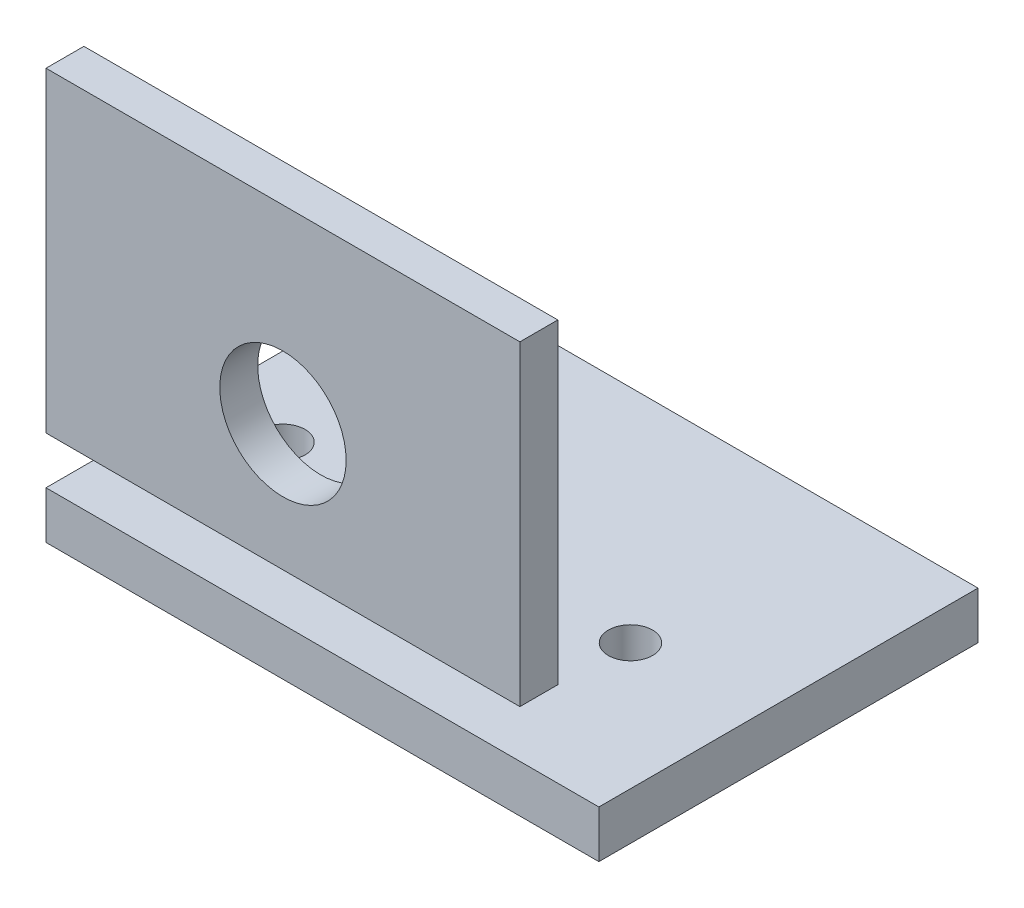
ISO-10303-21;
HEADER;
FILE_DESCRIPTION(('STEP AP214'),'2;1');
FILE_NAME('part.step','',(''),(''),'','','');
FILE_SCHEMA(('AUTOMOTIVE_DESIGN { 1 0 10303 214 1 1 1 1 }'));
ENDSEC;
DATA;
#1=APPLICATION_CONTEXT('core data for automotive mechanical design processes');
#2=APPLICATION_PROTOCOL_DEFINITION('international standard','automotive_design',2000,#1);
#3=PRODUCT_CONTEXT('',#1,'mechanical');
#4=PRODUCT('Part','Part','',(#3));
#5=PRODUCT_RELATED_PRODUCT_CATEGORY('part','',(#4));
#6=PRODUCT_DEFINITION_FORMATION('','',#4);
#7=PRODUCT_DEFINITION_CONTEXT('part definition',#1,'design');
#8=PRODUCT_DEFINITION('design','',#6,#7);
#9=PRODUCT_DEFINITION_SHAPE('','',#8);
#10=(LENGTH_UNIT() NAMED_UNIT(*) SI_UNIT(.MILLI.,.METRE.));
#11=(NAMED_UNIT(*) PLANE_ANGLE_UNIT() SI_UNIT($,.RADIAN.));
#12=(NAMED_UNIT(*) SI_UNIT($,.STERADIAN.) SOLID_ANGLE_UNIT());
#13=UNCERTAINTY_MEASURE_WITH_UNIT(LENGTH_MEASURE(1.E-05),#10,'distance_accuracy_value','');
#14=(GEOMETRIC_REPRESENTATION_CONTEXT(3) GLOBAL_UNCERTAINTY_ASSIGNED_CONTEXT((#13)) GLOBAL_UNIT_ASSIGNED_CONTEXT((#10,
#11,#12)) REPRESENTATION_CONTEXT('',''));
#15=CARTESIAN_POINT('',(0.,0.,0.));
#16=DIRECTION('',(0.,0.,1.));
#17=DIRECTION('',(1.,0.,0.));
#18=AXIS2_PLACEMENT_3D('',#15,#16,#17);
#19=CARTESIAN_POINT('',(0.,15.,-12.));
#20=DIRECTION('',(-1.,0.,0.));
#21=DIRECTION('',(0.,0.,1.));
#22=AXIS2_PLACEMENT_3D('',#19,#20,#21);
#23=PLANE('',#22);
#24=DIRECTION('',(0.,-1.,0.));
#25=VECTOR('',#24,1.);
#26=CARTESIAN_POINT('',(0.,15.,0.));
#27=LINE('',#26,#25);
#28=CARTESIAN_POINT('',(0.,115.,0.));
#29=VERTEX_POINT('',#28);
#30=CARTESIAN_POINT('',(0.,15.,0.));
#31=VERTEX_POINT('',#30);
#32=EDGE_CURVE('E116',#29,#31,#27,.T.);
#33=ORIENTED_EDGE('',*,*,#32,.F.);
#34=DIRECTION('',(0.,0.,1.));
#35=VECTOR('',#34,1.);
#36=CARTESIAN_POINT('',(0.,115.,-12.));
#37=LINE('',#36,#35);
#38=CARTESIAN_POINT('',(0.,115.,-12.));
#39=VERTEX_POINT('',#38);
#40=EDGE_CURVE('E12',#39,#29,#37,.T.);
#41=ORIENTED_EDGE('',*,*,#40,.F.);
#42=DIRECTION('',(0.,-1.,0.));
#43=VECTOR('',#42,1.);
#44=CARTESIAN_POINT('',(0.,15.,-12.));
#45=LINE('',#44,#43);
#46=CARTESIAN_POINT('',(0.,15.,-12.));
#47=VERTEX_POINT('',#46);
#48=EDGE_CURVE('E107',#39,#47,#45,.T.);
#49=ORIENTED_EDGE('',*,*,#48,.T.);
#50=DIRECTION('',(0.,0.,1.));
#51=VECTOR('',#50,1.);
#52=CARTESIAN_POINT('',(0.,15.,-12.));
#53=LINE('',#52,#51);
#54=EDGE_CURVE('E53',#47,#31,#53,.T.);
#55=ORIENTED_EDGE('',*,*,#54,.T.);
#56=EDGE_LOOP('',(#33,#41,#49,#55));
#57=FACE_BOUND('',#56,.T.);
#58=ADVANCED_FACE('F51',(#57),#23,.T.);
#59=CARTESIAN_POINT('',(0.,115.,-12.));
#60=DIRECTION('',(0.,1.,0.));
#61=DIRECTION('',(0.,0.,1.));
#62=AXIS2_PLACEMENT_3D('',#59,#60,#61);
#63=PLANE('',#62);
#64=DIRECTION('',(-1.,0.,0.));
#65=VECTOR('',#64,1.);
#66=CARTESIAN_POINT('',(0.,115.,0.));
#67=LINE('',#66,#65);
#68=CARTESIAN_POINT('',(150.,115.,0.));
#69=VERTEX_POINT('',#68);
#70=EDGE_CURVE('E111',#69,#29,#67,.T.);
#71=ORIENTED_EDGE('',*,*,#70,.F.);
#72=DIRECTION('',(0.,0.,1.));
#73=VECTOR('',#72,1.);
#74=CARTESIAN_POINT('',(150.,115.,-12.));
#75=LINE('',#74,#73);
#76=CARTESIAN_POINT('',(150.,115.,-12.));
#77=VERTEX_POINT('',#76);
#78=EDGE_CURVE('E58',#77,#69,#75,.T.);
#79=ORIENTED_EDGE('',*,*,#78,.F.);
#80=DIRECTION('',(-1.,0.,0.));
#81=VECTOR('',#80,1.);
#82=CARTESIAN_POINT('',(0.,115.,-12.));
#83=LINE('',#82,#81);
#84=EDGE_CURVE('E106',#77,#39,#83,.T.);
#85=ORIENTED_EDGE('',*,*,#84,.T.);
#86=ORIENTED_EDGE('',*,*,#40,.T.);
#87=EDGE_LOOP('',(#71,#79,#85,#86));
#88=FACE_BOUND('',#87,.T.);
#89=ADVANCED_FACE('F126',(#88),#63,.T.);
#90=CARTESIAN_POINT('',(150.,15.,-12.));
#91=DIRECTION('',(1.,0.,0.));
#92=DIRECTION('',(0.,0.,-1.));
#93=AXIS2_PLACEMENT_3D('',#90,#91,#92);
#94=PLANE('',#93);
#95=DIRECTION('',(0.,1.,0.));
#96=VECTOR('',#95,1.);
#97=CARTESIAN_POINT('',(150.,15.,0.));
#98=LINE('',#97,#96);
#99=CARTESIAN_POINT('',(150.,15.,0.));
#100=VERTEX_POINT('',#99);
#101=EDGE_CURVE('E103',#100,#69,#98,.T.);
#102=ORIENTED_EDGE('',*,*,#101,.F.);
#103=DIRECTION('',(0.,0.,1.));
#104=VECTOR('',#103,1.);
#105=CARTESIAN_POINT('',(150.,15.,-12.));
#106=LINE('',#105,#104);
#107=CARTESIAN_POINT('',(150.,15.,-12.));
#108=VERTEX_POINT('',#107);
#109=EDGE_CURVE('E98',#108,#100,#106,.T.);
#110=ORIENTED_EDGE('',*,*,#109,.F.);
#111=DIRECTION('',(0.,1.,0.));
#112=VECTOR('',#111,1.);
#113=CARTESIAN_POINT('',(150.,15.,-12.));
#114=LINE('',#113,#112);
#115=EDGE_CURVE('E100',#108,#77,#114,.T.);
#116=ORIENTED_EDGE('',*,*,#115,.T.);
#117=ORIENTED_EDGE('',*,*,#78,.T.);
#118=EDGE_LOOP('',(#102,#110,#116,#117));
#119=FACE_BOUND('',#118,.T.);
#120=ADVANCED_FACE('F96',(#119),#94,.T.);
#121=CARTESIAN_POINT('',(0.,15.,-12.));
#122=DIRECTION('',(0.,-1.,0.));
#123=DIRECTION('',(0.,0.,-1.));
#124=AXIS2_PLACEMENT_3D('',#121,#122,#123);
#125=PLANE('',#124);
#126=DIRECTION('',(1.,0.,0.));
#127=VECTOR('',#126,1.);
#128=CARTESIAN_POINT('',(0.,15.,0.));
#129=LINE('',#128,#127);
#130=EDGE_CURVE('E118',#31,#100,#129,.T.);
#131=ORIENTED_EDGE('',*,*,#130,.F.);
#132=ORIENTED_EDGE('',*,*,#54,.F.);
#133=DIRECTION('',(1.,0.,0.));
#134=VECTOR('',#133,1.);
#135=CARTESIAN_POINT('',(0.,15.,-12.));
#136=LINE('',#135,#134);
#137=EDGE_CURVE('E102',#47,#108,#136,.T.);
#138=ORIENTED_EDGE('',*,*,#137,.T.);
#139=ORIENTED_EDGE('',*,*,#109,.T.);
#140=EDGE_LOOP('',(#131,#132,#138,#139));
#141=FACE_BOUND('',#140,.T.);
#142=ADVANCED_FACE('F108',(#141),#125,.T.);
#143=CARTESIAN_POINT('',(0.,0.,-12.));
#144=DIRECTION('',(0.,0.,-1.));
#145=DIRECTION('',(-1.,0.,0.));
#146=AXIS2_PLACEMENT_3D('',#143,#144,#145);
#147=PLANE('',#146);
#148=CARTESIAN_POINT('',(75.,55.,-12.));
#149=DIRECTION('',(0.,0.,1.));
#150=DIRECTION('',(1.,0.,0.));
#151=AXIS2_PLACEMENT_3D('',#148,#149,#150);
#152=CIRCLE('',#151,20.);
#153=CARTESIAN_POINT('',(95.,55.,-12.));
#154=VERTEX_POINT('',#153);
#155=EDGE_CURVE('E119',#154,#154,#152,.T.);
#156=ORIENTED_EDGE('',*,*,#155,.T.);
#157=EDGE_LOOP('',(#156));
#158=FACE_BOUND('',#157,.T.);
#159=ORIENTED_EDGE('',*,*,#48,.F.);
#160=ORIENTED_EDGE('',*,*,#84,.F.);
#161=ORIENTED_EDGE('',*,*,#115,.F.);
#162=ORIENTED_EDGE('',*,*,#137,.F.);
#163=EDGE_LOOP('',(#159,#160,#161,#162));
#164=FACE_BOUND('',#163,.T.);
#165=ADVANCED_FACE('F104',(#158,#164),#147,.T.);
#166=CARTESIAN_POINT('',(0.,0.,0.));
#167=DIRECTION('',(0.,0.,-1.));
#168=DIRECTION('',(-1.,0.,0.));
#169=AXIS2_PLACEMENT_3D('',#166,#167,#168);
#170=PLANE('',#169);
#171=CARTESIAN_POINT('',(75.,55.,0.));
#172=DIRECTION('',(0.,0.,1.));
#173=DIRECTION('',(1.,0.,0.));
#174=AXIS2_PLACEMENT_3D('',#171,#172,#173);
#175=CIRCLE('',#174,20.);
#176=CARTESIAN_POINT('',(95.,55.,0.));
#177=VERTEX_POINT('',#176);
#178=EDGE_CURVE('E157',#177,#177,#175,.T.);
#179=ORIENTED_EDGE('',*,*,#178,.F.);
#180=EDGE_LOOP('',(#179));
#181=FACE_BOUND('',#180,.T.);
#182=ORIENTED_EDGE('',*,*,#32,.T.);
#183=ORIENTED_EDGE('',*,*,#130,.T.);
#184=ORIENTED_EDGE('',*,*,#101,.T.);
#185=ORIENTED_EDGE('',*,*,#70,.T.);
#186=EDGE_LOOP('',(#182,#183,#184,#185));
#187=FACE_BOUND('',#186,.T.);
#188=ADVANCED_FACE('F129',(#181,#187),#170,.F.);
#189=CARTESIAN_POINT('',(75.,55.,-12.));
#190=DIRECTION('',(0.,0.,1.));
#191=DIRECTION('',(1.,0.,0.));
#192=AXIS2_PLACEMENT_3D('',#189,#190,#191);
#193=CYLINDRICAL_SURFACE('',#192,20.);
#194=ORIENTED_EDGE('',*,*,#155,.F.);
#195=EDGE_LOOP('',(#194));
#196=FACE_BOUND('',#195,.T.);
#197=ORIENTED_EDGE('',*,*,#178,.T.);
#198=EDGE_LOOP('',(#197));
#199=FACE_BOUND('',#198,.T.);
#200=ADVANCED_FACE('F143',(#196,#199),#193,.F.);
#201=CLOSED_SHELL('',(#58,#89,#120,#142,#165,#188,#200));
#202=MANIFOLD_SOLID_BREP('B2',#201);
#203=CARTESIAN_POINT('',(0.,-15.,0.));
#204=DIRECTION('',(-1.,0.,0.));
#205=DIRECTION('',(0.,0.,1.));
#206=AXIS2_PLACEMENT_3D('',#203,#204,#205);
#207=PLANE('',#206);
#208=DIRECTION('',(0.,0.,1.));
#209=VECTOR('',#208,1.);
#210=CARTESIAN_POINT('',(0.,0.,0.));
#211=LINE('',#210,#209);
#212=CARTESIAN_POINT('',(0.,0.,-120.));
#213=VERTEX_POINT('',#212);
#214=CARTESIAN_POINT('',(0.,0.,0.));
#215=VERTEX_POINT('',#214);
#216=EDGE_CURVE('E262',#213,#215,#211,.T.);
#217=ORIENTED_EDGE('',*,*,#216,.F.);
#218=DIRECTION('',(0.,1.,0.));
#219=VECTOR('',#218,1.);
#220=CARTESIAN_POINT('',(0.,-15.,-120.));
#221=LINE('',#220,#219);
#222=CARTESIAN_POINT('',(0.,-15.,-120.));
#223=VERTEX_POINT('',#222);
#224=EDGE_CURVE('E47',#223,#213,#221,.T.);
#225=ORIENTED_EDGE('',*,*,#224,.F.);
#226=DIRECTION('',(0.,0.,1.));
#227=VECTOR('',#226,1.);
#228=CARTESIAN_POINT('',(0.,-15.,0.));
#229=LINE('',#228,#227);
#230=CARTESIAN_POINT('',(0.,-15.,0.));
#231=VERTEX_POINT('',#230);
#232=EDGE_CURVE('E251',#223,#231,#229,.T.);
#233=ORIENTED_EDGE('',*,*,#232,.T.);
#234=DIRECTION('',(0.,1.,0.));
#235=VECTOR('',#234,1.);
#236=CARTESIAN_POINT('',(0.,-15.,0.));
#237=LINE('',#236,#235);
#238=EDGE_CURVE('E196',#231,#215,#237,.T.);
#239=ORIENTED_EDGE('',*,*,#238,.T.);
#240=EDGE_LOOP('',(#217,#225,#233,#239));
#241=FACE_BOUND('',#240,.T.);
#242=ADVANCED_FACE('F197',(#241),#207,.T.);
#243=CARTESIAN_POINT('',(0.,-15.,-120.));
#244=DIRECTION('',(0.,0.,-1.));
#245=DIRECTION('',(-1.,0.,0.));
#246=AXIS2_PLACEMENT_3D('',#243,#244,#245);
#247=PLANE('',#246);
#248=DIRECTION('',(-1.,0.,0.));
#249=VECTOR('',#248,1.);
#250=CARTESIAN_POINT('',(0.,0.,-120.));
#251=LINE('',#250,#249);
#252=CARTESIAN_POINT('',(175.,0.,-120.));
#253=VERTEX_POINT('',#252);
#254=EDGE_CURVE('E259',#253,#213,#251,.T.);
#255=ORIENTED_EDGE('',*,*,#254,.F.);
#256=DIRECTION('',(0.,1.,0.));
#257=VECTOR('',#256,1.);
#258=CARTESIAN_POINT('',(175.,-15.,-120.));
#259=LINE('',#258,#257);
#260=CARTESIAN_POINT('',(175.,-15.,-120.));
#261=VERTEX_POINT('',#260);
#262=EDGE_CURVE('E205',#261,#253,#259,.T.);
#263=ORIENTED_EDGE('',*,*,#262,.F.);
#264=DIRECTION('',(-1.,0.,0.));
#265=VECTOR('',#264,1.);
#266=CARTESIAN_POINT('',(0.,-15.,-120.));
#267=LINE('',#266,#265);
#268=EDGE_CURVE('E252',#261,#223,#267,.T.);
#269=ORIENTED_EDGE('',*,*,#268,.T.);
#270=ORIENTED_EDGE('',*,*,#224,.T.);
#271=EDGE_LOOP('',(#255,#263,#269,#270));
#272=FACE_BOUND('',#271,.T.);
#273=ADVANCED_FACE('F275',(#272),#247,.T.);
#274=CARTESIAN_POINT('',(175.,-15.,0.));
#275=DIRECTION('',(1.,0.,0.));
#276=DIRECTION('',(0.,0.,-1.));
#277=AXIS2_PLACEMENT_3D('',#274,#275,#276);
#278=PLANE('',#277);
#279=DIRECTION('',(0.,0.,-1.));
#280=VECTOR('',#279,1.);
#281=CARTESIAN_POINT('',(175.,0.,0.));
#282=LINE('',#281,#280);
#283=CARTESIAN_POINT('',(175.,0.,0.));
#284=VERTEX_POINT('',#283);
#285=EDGE_CURVE('E246',#284,#253,#282,.T.);
#286=ORIENTED_EDGE('',*,*,#285,.F.);
#287=DIRECTION('',(0.,1.,0.));
#288=VECTOR('',#287,1.);
#289=CARTESIAN_POINT('',(175.,-15.,0.));
#290=LINE('',#289,#288);
#291=CARTESIAN_POINT('',(175.,-15.,0.));
#292=VERTEX_POINT('',#291);
#293=EDGE_CURVE('E241',#292,#284,#290,.T.);
#294=ORIENTED_EDGE('',*,*,#293,.F.);
#295=DIRECTION('',(0.,0.,-1.));
#296=VECTOR('',#295,1.);
#297=CARTESIAN_POINT('',(175.,-15.,0.));
#298=LINE('',#297,#296);
#299=EDGE_CURVE('E242',#292,#261,#298,.T.);
#300=ORIENTED_EDGE('',*,*,#299,.T.);
#301=ORIENTED_EDGE('',*,*,#262,.T.);
#302=EDGE_LOOP('',(#286,#294,#300,#301));
#303=FACE_BOUND('',#302,.T.);
#304=ADVANCED_FACE('F243',(#303),#278,.T.);
#305=CARTESIAN_POINT('',(0.,-15.,0.));
#306=DIRECTION('',(0.,0.,1.));
#307=DIRECTION('',(1.,0.,0.));
#308=AXIS2_PLACEMENT_3D('',#305,#306,#307);
#309=PLANE('',#308);
#310=DIRECTION('',(1.,0.,0.));
#311=VECTOR('',#310,1.);
#312=CARTESIAN_POINT('',(0.,0.,0.));
#313=LINE('',#312,#311);
#314=EDGE_CURVE('E261',#215,#284,#313,.T.);
#315=ORIENTED_EDGE('',*,*,#314,.F.);
#316=ORIENTED_EDGE('',*,*,#238,.F.);
#317=DIRECTION('',(1.,0.,0.));
#318=VECTOR('',#317,1.);
#319=CARTESIAN_POINT('',(0.,-15.,0.));
#320=LINE('',#319,#318);
#321=EDGE_CURVE('E249',#231,#292,#320,.T.);
#322=ORIENTED_EDGE('',*,*,#321,.T.);
#323=ORIENTED_EDGE('',*,*,#293,.T.);
#324=EDGE_LOOP('',(#315,#316,#322,#323));
#325=FACE_BOUND('',#324,.T.);
#326=ADVANCED_FACE('F254',(#325),#309,.T.);
#327=CARTESIAN_POINT('',(0.,-15.,0.));
#328=DIRECTION('',(0.,-1.,0.));
#329=DIRECTION('',(0.,0.,-1.));
#330=AXIS2_PLACEMENT_3D('',#327,#328,#329);
#331=PLANE('',#330);
#332=CARTESIAN_POINT('',(25.,-15.,-50.));
#333=DIRECTION('',(0.,1.,0.));
#334=DIRECTION('',(0.,0.,1.));
#335=AXIS2_PLACEMENT_3D('',#332,#333,#334);
#336=CIRCLE('',#335,7.);
#337=CARTESIAN_POINT('',(25.,-15.,-43.));
#338=VERTEX_POINT('',#337);
#339=EDGE_CURVE('E263',#338,#338,#336,.T.);
#340=ORIENTED_EDGE('',*,*,#339,.T.);
#341=EDGE_LOOP('',(#340));
#342=FACE_BOUND('',#341,.T.);
#343=CARTESIAN_POINT('',(135.,-15.,-50.));
#344=DIRECTION('',(0.,1.,0.));
#345=DIRECTION('',(0.,0.,1.));
#346=AXIS2_PLACEMENT_3D('',#343,#344,#345);
#347=CIRCLE('',#346,7.00000000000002);
#348=CARTESIAN_POINT('',(135.,-15.,-43.));
#349=VERTEX_POINT('',#348);
#350=EDGE_CURVE('E315',#349,#349,#347,.T.);
#351=ORIENTED_EDGE('',*,*,#350,.T.);
#352=EDGE_LOOP('',(#351));
#353=FACE_BOUND('',#352,.T.);
#354=ORIENTED_EDGE('',*,*,#232,.F.);
#355=ORIENTED_EDGE('',*,*,#268,.F.);
#356=ORIENTED_EDGE('',*,*,#299,.F.);
#357=ORIENTED_EDGE('',*,*,#321,.F.);
#358=EDGE_LOOP('',(#354,#355,#356,#357));
#359=FACE_BOUND('',#358,.T.);
#360=ADVANCED_FACE('F248',(#342,#353,#359),#331,.T.);
#361=CARTESIAN_POINT('',(0.,0.,0.));
#362=DIRECTION('',(0.,-1.,0.));
#363=DIRECTION('',(0.,0.,-1.));
#364=AXIS2_PLACEMENT_3D('',#361,#362,#363);
#365=PLANE('',#364);
#366=CARTESIAN_POINT('',(25.,0.,-50.));
#367=DIRECTION('',(0.,1.,0.));
#368=DIRECTION('',(0.,0.,1.));
#369=AXIS2_PLACEMENT_3D('',#366,#367,#368);
#370=CIRCLE('',#369,7.);
#371=CARTESIAN_POINT('',(25.,0.,-43.));
#372=VERTEX_POINT('',#371);
#373=EDGE_CURVE('E310',#372,#372,#370,.T.);
#374=ORIENTED_EDGE('',*,*,#373,.F.);
#375=EDGE_LOOP('',(#374));
#376=FACE_BOUND('',#375,.T.);
#377=CARTESIAN_POINT('',(135.,0.,-50.));
#378=DIRECTION('',(0.,1.,0.));
#379=DIRECTION('',(0.,0.,1.));
#380=AXIS2_PLACEMENT_3D('',#377,#378,#379);
#381=CIRCLE('',#380,7.00000000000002);
#382=CARTESIAN_POINT('',(135.,0.,-43.));
#383=VERTEX_POINT('',#382);
#384=EDGE_CURVE('E308',#383,#383,#381,.T.);
#385=ORIENTED_EDGE('',*,*,#384,.F.);
#386=EDGE_LOOP('',(#385));
#387=FACE_BOUND('',#386,.T.);
#388=ORIENTED_EDGE('',*,*,#216,.T.);
#389=ORIENTED_EDGE('',*,*,#314,.T.);
#390=ORIENTED_EDGE('',*,*,#285,.T.);
#391=ORIENTED_EDGE('',*,*,#254,.T.);
#392=EDGE_LOOP('',(#388,#389,#390,#391));
#393=FACE_BOUND('',#392,.T.);
#394=ADVANCED_FACE('F272',(#376,#387,#393),#365,.F.);
#395=CARTESIAN_POINT('',(135.,-15.,-50.));
#396=DIRECTION('',(0.,1.,0.));
#397=DIRECTION('',(0.,0.,1.));
#398=AXIS2_PLACEMENT_3D('',#395,#396,#397);
#399=CYLINDRICAL_SURFACE('',#398,7.00000000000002);
#400=ORIENTED_EDGE('',*,*,#350,.F.);
#401=EDGE_LOOP('',(#400));
#402=FACE_BOUND('',#401,.T.);
#403=ORIENTED_EDGE('',*,*,#384,.T.);
#404=EDGE_LOOP('',(#403));
#405=FACE_BOUND('',#404,.T.);
#406=ADVANCED_FACE('F290',(#402,#405),#399,.F.);
#407=CARTESIAN_POINT('',(25.,-15.,-50.));
#408=DIRECTION('',(0.,1.,0.));
#409=DIRECTION('',(0.,0.,1.));
#410=AXIS2_PLACEMENT_3D('',#407,#408,#409);
#411=CYLINDRICAL_SURFACE('',#410,7.);
#412=ORIENTED_EDGE('',*,*,#339,.F.);
#413=EDGE_LOOP('',(#412));
#414=FACE_BOUND('',#413,.T.);
#415=ORIENTED_EDGE('',*,*,#373,.T.);
#416=EDGE_LOOP('',(#415));
#417=FACE_BOUND('',#416,.T.);
#418=ADVANCED_FACE('F300',(#414,#417),#411,.F.);
#419=CLOSED_SHELL('',(#242,#273,#304,#326,#360,#394,#406,#418));
#420=MANIFOLD_SOLID_BREP('B6',#419);
#421=ADVANCED_BREP_SHAPE_REPRESENTATION('',(#18,#202,#420),#14);
#422=SHAPE_DEFINITION_REPRESENTATION(#9,#421);
ENDSEC;
END-ISO-10303-21;
